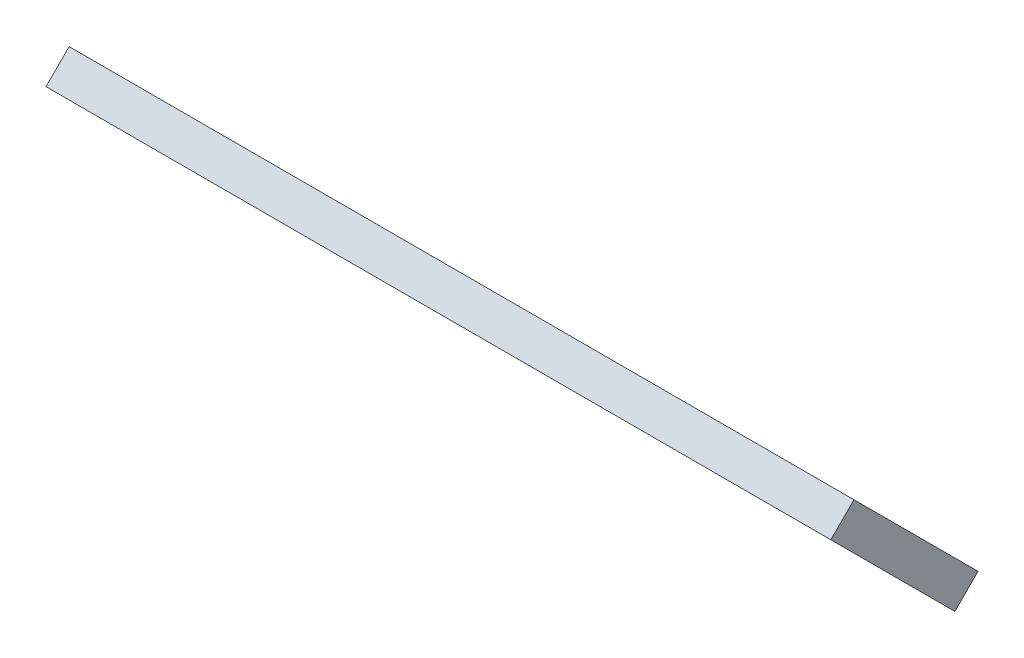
ISO-10303-21;
HEADER;
FILE_DESCRIPTION(('STEP AP214'),'2;1');
FILE_NAME('part.step','',(''),(''),'','','');
FILE_SCHEMA(('AUTOMOTIVE_DESIGN { 1 0 10303 214 1 1 1 1 }'));
ENDSEC;
DATA;
#1=APPLICATION_CONTEXT('core data for automotive mechanical design processes');
#2=APPLICATION_PROTOCOL_DEFINITION('international standard','automotive_design',2000,#1);
#3=PRODUCT_CONTEXT('',#1,'mechanical');
#4=PRODUCT('Part','Part','',(#3));
#5=PRODUCT_RELATED_PRODUCT_CATEGORY('part','',(#4));
#6=PRODUCT_DEFINITION_FORMATION('','',#4);
#7=PRODUCT_DEFINITION_CONTEXT('part definition',#1,'design');
#8=PRODUCT_DEFINITION('design','',#6,#7);
#9=PRODUCT_DEFINITION_SHAPE('','',#8);
#10=(LENGTH_UNIT() NAMED_UNIT(*) SI_UNIT(.MILLI.,.METRE.));
#11=(NAMED_UNIT(*) PLANE_ANGLE_UNIT() SI_UNIT($,.RADIAN.));
#12=(NAMED_UNIT(*) SI_UNIT($,.STERADIAN.) SOLID_ANGLE_UNIT());
#13=UNCERTAINTY_MEASURE_WITH_UNIT(LENGTH_MEASURE(1.E-05),#10,'distance_accuracy_value','');
#14=(GEOMETRIC_REPRESENTATION_CONTEXT(3) GLOBAL_UNCERTAINTY_ASSIGNED_CONTEXT((#13)) GLOBAL_UNIT_ASSIGNED_CONTEXT((#10,
#11,#12)) REPRESENTATION_CONTEXT('',''));
#15=CARTESIAN_POINT('',(0.,0.,0.));
#16=DIRECTION('',(0.,0.,1.));
#17=DIRECTION('',(1.,0.,0.));
#18=AXIS2_PLACEMENT_3D('',#15,#16,#17);
#19=CARTESIAN_POINT('',(-19.05,-1.12253201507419,1.12253201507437));
#20=DIRECTION('',(0.,-0.707106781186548,0.707106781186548));
#21=DIRECTION('',(0.,-0.707106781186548,-0.707106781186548));
#22=AXIS2_PLACEMENT_3D('',#19,#20,#21);
#23=CONICAL_SURFACE('',#22,4.29078831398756,0.709860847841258);
#24=CARTESIAN_POINT('',(-19.05,0.673519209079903,-0.673519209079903));
#25=DIRECTION('',(0.,0.707106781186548,-0.707106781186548));
#26=DIRECTION('',(0.,0.707106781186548,0.707106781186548));
#27=AXIS2_PLACEMENT_3D('',#24,#25,#26);
#28=CIRCLE('',#27,2.1082);
#29=CARTESIAN_POINT('',(-21.1582000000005,0.673519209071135,-0.673519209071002));
#30=VERTEX_POINT('',#29);
#31=CARTESIAN_POINT('',(-16.9418000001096,0.673519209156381,-0.67351920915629));
#32=VERTEX_POINT('',#31);
#33=EDGE_CURVE('E122',#30,#32,#28,.T.);
#34=ORIENTED_EDGE('',*,*,#33,.T.);
#35=DIRECTION('',(-0.6517282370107,0.536306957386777,-0.536306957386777));
#36=VECTOR('',#35,1.);
#37=CARTESIAN_POINT('',(498961.900000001,-410608.855497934,410608.855497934));
#38=LINE('',#37,#36);
#39=CARTESIAN_POINT('',(-14.7592116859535,-1.12253201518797,1.12253201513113));
#40=VERTEX_POINT('',#39);
#41=EDGE_CURVE('E90',#32,#40,#38,.F.);
#42=ORIENTED_EDGE('',*,*,#41,.T.);
#43=CARTESIAN_POINT('',(-19.05,-1.12253201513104,1.12253201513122));
#44=DIRECTION('',(0.,-0.707106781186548,0.707106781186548));
#45=DIRECTION('',(0.,-0.707106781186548,-0.707106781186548));
#46=AXIS2_PLACEMENT_3D('',#43,#44,#45);
#47=CIRCLE('',#46,4.29078831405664);
#48=CARTESIAN_POINT('',(-23.3407883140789,-1.12253201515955,1.12253201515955));
#49=VERTEX_POINT('',#48);
#50=EDGE_CURVE('E104',#49,#40,#47,.F.);
#51=ORIENTED_EDGE('',*,*,#50,.F.);
#52=DIRECTION('',(0.651728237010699,0.536306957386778,-0.536306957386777));
#53=VECTOR('',#52,1.);
#54=CARTESIAN_POINT('',(-499000.,-410608.855497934,410608.855497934));
#55=LINE('',#54,#53);
#56=EDGE_CURVE('E95',#49,#30,#55,.T.);
#57=ORIENTED_EDGE('',*,*,#56,.T.);
#58=EDGE_LOOP('',(#34,#42,#51,#57));
#59=FACE_BOUND('',#58,.T.);
#60=ADVANCED_FACE('F16',(#59),#23,.F.);
#61=CARTESIAN_POINT('',(-19.05,-1.12253201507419,1.12253201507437));
#62=DIRECTION('',(0.,-0.707106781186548,0.707106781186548));
#63=DIRECTION('',(0.,-0.707106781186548,-0.707106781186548));
#64=AXIS2_PLACEMENT_3D('',#61,#62,#63);
#65=CONICAL_SURFACE('',#64,4.29078831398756,0.709860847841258);
#66=CARTESIAN_POINT('',(-19.05,-1.12253201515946,1.12253201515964));
#67=DIRECTION('',(0.,-0.707106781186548,0.707106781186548));
#68=DIRECTION('',(0.,-0.707106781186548,-0.707106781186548));
#69=AXIS2_PLACEMENT_3D('',#66,#67,#68);
#70=CIRCLE('',#69,4.29078831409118);
#71=EDGE_CURVE('E19',#40,#49,#70,.F.);
#72=ORIENTED_EDGE('',*,*,#71,.F.);
#73=ORIENTED_EDGE('',*,*,#41,.F.);
#74=CARTESIAN_POINT('',(-19.05,0.673519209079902,-0.673519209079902));
#75=DIRECTION('',(0.,0.707106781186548,-0.707106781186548));
#76=DIRECTION('',(0.,0.707106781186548,0.707106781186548));
#77=AXIS2_PLACEMENT_3D('',#74,#75,#76);
#78=CIRCLE('',#77,2.1082);
#79=EDGE_CURVE('E100',#32,#30,#78,.T.);
#80=ORIENTED_EDGE('',*,*,#79,.T.);
#81=ORIENTED_EDGE('',*,*,#56,.F.);
#82=EDGE_LOOP('',(#72,#73,#80,#81));
#83=FACE_BOUND('',#82,.T.);
#84=ADVANCED_FACE('F96',(#83),#65,.F.);
#85=CARTESIAN_POINT('',(19.05,-1.12253201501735,1.12253201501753));
#86=DIRECTION('',(0.,-0.707106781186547,0.707106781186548));
#87=DIRECTION('',(0.,-0.707106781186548,-0.707106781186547));
#88=AXIS2_PLACEMENT_3D('',#85,#86,#87);
#89=CONICAL_SURFACE('',#88,4.29078831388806,0.709860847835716);
#90=CARTESIAN_POINT('',(19.05,0.673519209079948,-0.673519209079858));
#91=DIRECTION('',(0.,0.707106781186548,-0.707106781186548));
#92=DIRECTION('',(0.,0.707106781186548,0.707106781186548));
#93=AXIS2_PLACEMENT_3D('',#90,#91,#92);
#94=CIRCLE('',#93,2.1082);
#95=CARTESIAN_POINT('',(16.9418000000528,0.673519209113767,-0.673519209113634));
#96=VERTEX_POINT('',#95);
#97=CARTESIAN_POINT('',(21.1581999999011,0.673519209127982,-0.673519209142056));
#98=VERTEX_POINT('',#97);
#99=EDGE_CURVE('E163',#96,#98,#94,.T.);
#100=ORIENTED_EDGE('',*,*,#99,.T.);
#101=DIRECTION('',(-0.6517282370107,0.536306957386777,-0.536306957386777));
#102=VECTOR('',#101,1.);
#103=CARTESIAN_POINT('',(499038.100000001,-410640.207975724,410640.207975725));
#104=LINE('',#103,#102);
#105=CARTESIAN_POINT('',(23.3407883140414,-1.12253201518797,1.12253201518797));
#106=VERTEX_POINT('',#105);
#107=EDGE_CURVE('E102',#98,#106,#104,.F.);
#108=ORIENTED_EDGE('',*,*,#107,.T.);
#109=CARTESIAN_POINT('',(19.05,-1.12253201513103,1.12253201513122));
#110=DIRECTION('',(0.,-0.707106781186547,0.707106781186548));
#111=DIRECTION('',(0.,-0.707106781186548,-0.707106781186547));
#112=AXIS2_PLACEMENT_3D('',#109,#110,#111);
#113=CIRCLE('',#112,4.29078831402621);
#114=CARTESIAN_POINT('',(14.7592116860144,-1.12253201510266,1.12253201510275));
#115=VERTEX_POINT('',#114);
#116=EDGE_CURVE('E125',#115,#106,#113,.F.);
#117=ORIENTED_EDGE('',*,*,#116,.F.);
#118=DIRECTION('',(0.651728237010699,0.536306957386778,-0.536306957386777));
#119=VECTOR('',#118,1.);
#120=CARTESIAN_POINT('',(-499000.,-410640.207975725,410640.207975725));
#121=LINE('',#120,#119);
#122=EDGE_CURVE('E108',#115,#96,#121,.T.);
#123=ORIENTED_EDGE('',*,*,#122,.T.);
#124=EDGE_LOOP('',(#100,#108,#117,#123));
#125=FACE_BOUND('',#124,.T.);
#126=ADVANCED_FACE('F162',(#125),#89,.F.);
#127=CARTESIAN_POINT('',(19.05,-1.12253201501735,1.12253201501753));
#128=DIRECTION('',(0.,-0.707106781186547,0.707106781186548));
#129=DIRECTION('',(0.,-0.707106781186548,-0.707106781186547));
#130=AXIS2_PLACEMENT_3D('',#127,#128,#129);
#131=CONICAL_SURFACE('',#130,4.29078831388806,0.709860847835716);
#132=CARTESIAN_POINT('',(19.05,-1.12253201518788,1.12253201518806));
#133=DIRECTION('',(0.,-0.707106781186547,0.707106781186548));
#134=DIRECTION('',(0.,-0.707106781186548,-0.707106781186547));
#135=AXIS2_PLACEMENT_3D('',#132,#133,#134);
#136=CIRCLE('',#135,4.29078831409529);
#137=EDGE_CURVE('E106',#106,#115,#136,.F.);
#138=ORIENTED_EDGE('',*,*,#137,.F.);
#139=ORIENTED_EDGE('',*,*,#107,.F.);
#140=CARTESIAN_POINT('',(19.05,0.673519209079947,-0.673519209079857));
#141=DIRECTION('',(0.,0.707106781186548,-0.707106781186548));
#142=DIRECTION('',(0.,0.707106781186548,0.707106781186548));
#143=AXIS2_PLACEMENT_3D('',#140,#141,#142);
#144=CIRCLE('',#143,2.1082);
#145=EDGE_CURVE('E160',#98,#96,#144,.T.);
#146=ORIENTED_EDGE('',*,*,#145,.T.);
#147=ORIENTED_EDGE('',*,*,#122,.F.);
#148=EDGE_LOOP('',(#138,#139,#146,#147));
#149=FACE_BOUND('',#148,.T.);
#150=ADVANCED_FACE('F158',(#149),#131,.F.);
#151=CARTESIAN_POINT('',(38.1,4.89868596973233,7.14375));
#152=DIRECTION('',(0.,-0.707106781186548,0.707106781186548));
#153=DIRECTION('',(0.,-0.707106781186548,-0.707106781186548));
#154=AXIS2_PLACEMENT_3D('',#151,#152,#153);
#155=PLANE('',#154);
#156=DIRECTION('',(0.,0.707106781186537,0.707106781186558));
#157=VECTOR('',#156,1.);
#158=CARTESIAN_POINT('',(38.1,-7.14375,-4.89868596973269));
#159=LINE('',#158,#157);
#160=CARTESIAN_POINT('',(38.1,-7.14375000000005,-4.89868596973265));
#161=VERTEX_POINT('',#160);
#162=CARTESIAN_POINT('',(38.1,4.89868596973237,7.14375000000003));
#163=VERTEX_POINT('',#162);
#164=EDGE_CURVE('E300',#161,#163,#159,.T.);
#165=ORIENTED_EDGE('',*,*,#164,.T.);
#166=DIRECTION('',(1.,0.,0.));
#167=VECTOR('',#166,1.);
#168=CARTESIAN_POINT('',(38.1,4.89868596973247,7.14375000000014));
#169=LINE('',#168,#167);
#170=CARTESIAN_POINT('',(-38.1,4.89868596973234,7.14375000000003));
#171=VERTEX_POINT('',#170);
#172=EDGE_CURVE('E302',#171,#163,#169,.T.);
#173=ORIENTED_EDGE('',*,*,#172,.F.);
#174=DIRECTION('',(0.,0.707106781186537,0.707106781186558));
#175=VECTOR('',#174,1.);
#176=CARTESIAN_POINT('',(-38.1,-7.14375,-4.89868596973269));
#177=LINE('',#176,#175);
#178=CARTESIAN_POINT('',(-38.1,-7.14375000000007,-4.89868596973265));
#179=VERTEX_POINT('',#178);
#180=EDGE_CURVE('E319',#179,#171,#177,.T.);
#181=ORIENTED_EDGE('',*,*,#180,.F.);
#182=DIRECTION('',(1.,0.,0.));
#183=VECTOR('',#182,1.);
#184=CARTESIAN_POINT('',(38.1,-7.14375,-4.89868596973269));
#185=LINE('',#184,#183);
#186=EDGE_CURVE('E150',#161,#179,#185,.F.);
#187=ORIENTED_EDGE('',*,*,#186,.F.);
#188=EDGE_LOOP('',(#165,#173,#181,#187));
#189=FACE_BOUND('',#188,.T.);
#190=ORIENTED_EDGE('',*,*,#137,.T.);
#191=ORIENTED_EDGE('',*,*,#116,.T.);
#192=EDGE_LOOP('',(#190,#191));
#193=FACE_BOUND('',#192,.T.);
#194=ORIENTED_EDGE('',*,*,#71,.T.);
#195=ORIENTED_EDGE('',*,*,#50,.T.);
#196=EDGE_LOOP('',(#194,#195));
#197=FACE_BOUND('',#196,.T.);
#198=ADVANCED_FACE('F107',(#189,#193,#197),#155,.T.);
#199=CARTESIAN_POINT('',(-19.05,1.12253201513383,-1.12253201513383));
#200=DIRECTION('',(0.,0.707106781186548,-0.707106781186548));
#201=DIRECTION('',(0.,0.707106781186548,0.707106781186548));
#202=AXIS2_PLACEMENT_3D('',#199,#200,#201);
#203=CYLINDRICAL_SURFACE('',#202,2.1082);
#204=CARTESIAN_POINT('',(-19.05,1.12253201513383,-1.12253201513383));
#205=DIRECTION('',(0.,0.707106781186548,-0.707106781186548));
#206=DIRECTION('',(0.,0.707106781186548,0.707106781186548));
#207=AXIS2_PLACEMENT_3D('',#204,#205,#206);
#208=CIRCLE('',#207,2.1082);
#209=CARTESIAN_POINT('',(-16.9418,1.12253201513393,-1.12253201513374));
#210=VERTEX_POINT('',#209);
#211=CARTESIAN_POINT('',(-21.1582,1.12253201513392,-1.12253201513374));
#212=VERTEX_POINT('',#211);
#213=EDGE_CURVE('E147',#210,#212,#208,.F.);
#214=ORIENTED_EDGE('',*,*,#213,.F.);
#215=DIRECTION('',(0.,0.707106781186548,-0.707106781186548));
#216=VECTOR('',#215,1.);
#217=CARTESIAN_POINT('',(-16.9418,1.12253201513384,-1.12253201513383));
#218=LINE('',#217,#216);
#219=EDGE_CURVE('E124',#210,#32,#218,.F.);
#220=ORIENTED_EDGE('',*,*,#219,.T.);
#221=ORIENTED_EDGE('',*,*,#33,.F.);
#222=DIRECTION('',(0.,0.707106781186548,-0.707106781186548));
#223=VECTOR('',#222,1.);
#224=CARTESIAN_POINT('',(-21.1582,1.12253201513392,-1.12253201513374));
#225=LINE('',#224,#223);
#226=EDGE_CURVE('E129',#30,#212,#225,.T.);
#227=ORIENTED_EDGE('',*,*,#226,.T.);
#228=EDGE_LOOP('',(#214,#220,#221,#227));
#229=FACE_BOUND('',#228,.T.);
#230=ADVANCED_FACE('F191',(#229),#203,.F.);
#231=CARTESIAN_POINT('',(-19.05,1.12253201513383,-1.12253201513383));
#232=DIRECTION('',(0.,0.707106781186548,-0.707106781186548));
#233=DIRECTION('',(0.,0.707106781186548,0.707106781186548));
#234=AXIS2_PLACEMENT_3D('',#231,#232,#233);
#235=CYLINDRICAL_SURFACE('',#234,2.1082);
#236=ORIENTED_EDGE('',*,*,#79,.F.);
#237=ORIENTED_EDGE('',*,*,#219,.F.);
#238=CARTESIAN_POINT('',(-19.05,1.12253201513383,-1.12253201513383));
#239=DIRECTION('',(0.,0.707106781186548,-0.707106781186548));
#240=DIRECTION('',(0.,0.707106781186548,0.707106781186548));
#241=AXIS2_PLACEMENT_3D('',#238,#239,#240);
#242=CIRCLE('',#241,2.1082);
#243=EDGE_CURVE('E144',#212,#210,#242,.F.);
#244=ORIENTED_EDGE('',*,*,#243,.F.);
#245=ORIENTED_EDGE('',*,*,#226,.F.);
#246=EDGE_LOOP('',(#236,#237,#244,#245));
#247=FACE_BOUND('',#246,.T.);
#248=ADVANCED_FACE('F195',(#247),#235,.F.);
#249=CARTESIAN_POINT('',(19.05,1.12253201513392,-1.12253201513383));
#250=DIRECTION('',(0.,0.707106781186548,-0.707106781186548));
#251=DIRECTION('',(0.,0.707106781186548,0.707106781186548));
#252=AXIS2_PLACEMENT_3D('',#249,#250,#251);
#253=CYLINDRICAL_SURFACE('',#252,2.1082);
#254=CARTESIAN_POINT('',(19.05,1.12253201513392,-1.12253201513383));
#255=DIRECTION('',(0.,0.707106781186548,-0.707106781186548));
#256=DIRECTION('',(0.,0.707106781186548,0.707106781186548));
#257=AXIS2_PLACEMENT_3D('',#254,#255,#256);
#258=CIRCLE('',#257,2.1082);
#259=CARTESIAN_POINT('',(21.1582,1.12253201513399,-1.12253201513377));
#260=VERTEX_POINT('',#259);
#261=CARTESIAN_POINT('',(16.9418,1.12253201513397,-1.12253201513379));
#262=VERTEX_POINT('',#261);
#263=EDGE_CURVE('E141',#260,#262,#258,.F.);
#264=ORIENTED_EDGE('',*,*,#263,.F.);
#265=DIRECTION('',(0.,0.707106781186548,-0.707106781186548));
#266=VECTOR('',#265,1.);
#267=CARTESIAN_POINT('',(21.1582,1.12253201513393,-1.12253201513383));
#268=LINE('',#267,#266);
#269=EDGE_CURVE('E167',#260,#98,#268,.F.);
#270=ORIENTED_EDGE('',*,*,#269,.T.);
#271=ORIENTED_EDGE('',*,*,#99,.F.);
#272=DIRECTION('',(0.,0.707106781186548,-0.707106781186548));
#273=VECTOR('',#272,1.);
#274=CARTESIAN_POINT('',(16.9418,1.12253201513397,-1.12253201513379));
#275=LINE('',#274,#273);
#276=EDGE_CURVE('E174',#96,#262,#275,.T.);
#277=ORIENTED_EDGE('',*,*,#276,.T.);
#278=EDGE_LOOP('',(#264,#270,#271,#277));
#279=FACE_BOUND('',#278,.T.);
#280=ADVANCED_FACE('F170',(#279),#253,.F.);
#281=CARTESIAN_POINT('',(19.05,1.12253201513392,-1.12253201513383));
#282=DIRECTION('',(0.,0.707106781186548,-0.707106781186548));
#283=DIRECTION('',(0.,0.707106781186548,0.707106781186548));
#284=AXIS2_PLACEMENT_3D('',#281,#282,#283);
#285=CYLINDRICAL_SURFACE('',#284,2.1082);
#286=ORIENTED_EDGE('',*,*,#145,.F.);
#287=ORIENTED_EDGE('',*,*,#269,.F.);
#288=CARTESIAN_POINT('',(19.05,1.12253201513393,-1.12253201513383));
#289=DIRECTION('',(0.,0.707106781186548,-0.707106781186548));
#290=DIRECTION('',(0.,0.707106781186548,0.707106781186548));
#291=AXIS2_PLACEMENT_3D('',#288,#289,#290);
#292=CIRCLE('',#291,2.1082);
#293=EDGE_CURVE('E137',#262,#260,#292,.F.);
#294=ORIENTED_EDGE('',*,*,#293,.F.);
#295=ORIENTED_EDGE('',*,*,#276,.F.);
#296=EDGE_LOOP('',(#286,#287,#294,#295));
#297=FACE_BOUND('',#296,.T.);
#298=ADVANCED_FACE('F221',(#297),#285,.F.);
#299=CARTESIAN_POINT('',(-38.1,4.89868596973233,7.14375));
#300=DIRECTION('',(-1.,0.,0.));
#301=DIRECTION('',(0.,-1.,0.));
#302=AXIS2_PLACEMENT_3D('',#299,#300,#301);
#303=PLANE('',#302);
#304=DIRECTION('',(0.,0.707106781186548,0.707106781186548));
#305=VECTOR('',#304,1.);
#306=CARTESIAN_POINT('',(-38.1,-4.89868596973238,-7.14374999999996));
#307=LINE('',#306,#305);
#308=CARTESIAN_POINT('',(-38.1,-4.8986859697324,-7.14375000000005));
#309=VERTEX_POINT('',#308);
#310=CARTESIAN_POINT('',(-38.1,7.14375,4.89868596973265));
#311=VERTEX_POINT('',#310);
#312=EDGE_CURVE('E140',#309,#311,#307,.T.);
#313=ORIENTED_EDGE('',*,*,#312,.F.);
#314=DIRECTION('',(0.,0.707106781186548,-0.707106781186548));
#315=VECTOR('',#314,1.);
#316=CARTESIAN_POINT('',(-38.1,-7.14375000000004,-4.89868596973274));
#317=LINE('',#316,#315);
#318=EDGE_CURVE('E312',#179,#309,#317,.T.);
#319=ORIENTED_EDGE('',*,*,#318,.F.);
#320=ORIENTED_EDGE('',*,*,#180,.T.);
#321=DIRECTION('',(0.,-0.707106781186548,0.707106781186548));
#322=VECTOR('',#321,1.);
#323=CARTESIAN_POINT('',(-38.1,7.14374999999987,4.89868596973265));
#324=LINE('',#323,#322);
#325=EDGE_CURVE('E309',#311,#171,#324,.T.);
#326=ORIENTED_EDGE('',*,*,#325,.F.);
#327=EDGE_LOOP('',(#313,#319,#320,#326));
#328=FACE_BOUND('',#327,.T.);
#329=ADVANCED_FACE('F217',(#328),#303,.T.);
#330=CARTESIAN_POINT('',(38.1,7.14374999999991,4.89868596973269));
#331=DIRECTION('',(0.,0.707106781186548,0.707106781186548));
#332=DIRECTION('',(0.,-0.707106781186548,0.707106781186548));
#333=AXIS2_PLACEMENT_3D('',#330,#331,#332);
#334=PLANE('',#333);
#335=DIRECTION('',(0.,0.70710678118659,-0.707106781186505));
#336=VECTOR('',#335,1.);
#337=CARTESIAN_POINT('',(38.1,4.89868596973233,7.14375));
#338=LINE('',#337,#336);
#339=CARTESIAN_POINT('',(38.1,7.14374999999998,4.89868596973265));
#340=VERTEX_POINT('',#339);
#341=EDGE_CURVE('E306',#163,#340,#338,.T.);
#342=ORIENTED_EDGE('',*,*,#341,.T.);
#343=DIRECTION('',(1.,0.,0.));
#344=VECTOR('',#343,1.);
#345=CARTESIAN_POINT('',(38.1,7.14375000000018,4.89868596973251));
#346=LINE('',#345,#344);
#347=EDGE_CURVE('E325',#311,#340,#346,.T.);
#348=ORIENTED_EDGE('',*,*,#347,.F.);
#349=ORIENTED_EDGE('',*,*,#325,.T.);
#350=ORIENTED_EDGE('',*,*,#172,.T.);
#351=EDGE_LOOP('',(#342,#348,#349,#350));
#352=FACE_BOUND('',#351,.T.);
#353=ADVANCED_FACE('F214',(#352),#334,.T.);
#354=CARTESIAN_POINT('',(38.1,0.,0.));
#355=DIRECTION('',(-1.,0.,0.));
#356=DIRECTION('',(0.,-1.,0.));
#357=AXIS2_PLACEMENT_3D('',#354,#355,#356);
#358=PLANE('',#357);
#359=ORIENTED_EDGE('',*,*,#164,.F.);
#360=DIRECTION('',(0.,0.707106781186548,-0.707106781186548));
#361=VECTOR('',#360,1.);
#362=CARTESIAN_POINT('',(38.1,-7.14375,-4.89868596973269));
#363=LINE('',#362,#361);
#364=CARTESIAN_POINT('',(38.1,-4.89868596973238,-7.14375000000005));
#365=VERTEX_POINT('',#364);
#366=EDGE_CURVE('E34',#365,#161,#363,.F.);
#367=ORIENTED_EDGE('',*,*,#366,.F.);
#368=DIRECTION('',(0.,0.707106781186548,0.707106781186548));
#369=VECTOR('',#368,1.);
#370=CARTESIAN_POINT('',(38.1,-4.89868596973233,-7.14375));
#371=LINE('',#370,#369);
#372=EDGE_CURVE('E25',#340,#365,#371,.F.);
#373=ORIENTED_EDGE('',*,*,#372,.F.);
#374=ORIENTED_EDGE('',*,*,#341,.F.);
#375=EDGE_LOOP('',(#359,#367,#373,#374));
#376=FACE_BOUND('',#375,.T.);
#377=ADVANCED_FACE('F206',(#376),#358,.F.);
#378=CARTESIAN_POINT('',(38.1,-7.14375,-4.89868596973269));
#379=DIRECTION('',(0.,-0.707106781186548,-0.707106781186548));
#380=DIRECTION('',(0.,0.707106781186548,-0.707106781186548));
#381=AXIS2_PLACEMENT_3D('',#378,#379,#380);
#382=PLANE('',#381);
#383=ORIENTED_EDGE('',*,*,#366,.T.);
#384=ORIENTED_EDGE('',*,*,#186,.T.);
#385=ORIENTED_EDGE('',*,*,#318,.T.);
#386=DIRECTION('',(1.,0.,0.));
#387=VECTOR('',#386,1.);
#388=CARTESIAN_POINT('',(38.1,-4.89868596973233,-7.14375));
#389=LINE('',#388,#387);
#390=EDGE_CURVE('E11',#365,#309,#389,.F.);
#391=ORIENTED_EDGE('',*,*,#390,.F.);
#392=EDGE_LOOP('',(#383,#384,#385,#391));
#393=FACE_BOUND('',#392,.T.);
#394=ADVANCED_FACE('F199',(#393),#382,.T.);
#395=CARTESIAN_POINT('',(38.1,-4.89868596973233,-7.14375));
#396=DIRECTION('',(0.,0.707106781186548,-0.707106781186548));
#397=DIRECTION('',(0.,0.707106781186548,0.707106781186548));
#398=AXIS2_PLACEMENT_3D('',#395,#396,#397);
#399=PLANE('',#398);
#400=ORIENTED_EDGE('',*,*,#372,.T.);
#401=ORIENTED_EDGE('',*,*,#390,.T.);
#402=ORIENTED_EDGE('',*,*,#312,.T.);
#403=ORIENTED_EDGE('',*,*,#347,.T.);
#404=EDGE_LOOP('',(#400,#401,#402,#403));
#405=FACE_BOUND('',#404,.T.);
#406=ORIENTED_EDGE('',*,*,#263,.T.);
#407=ORIENTED_EDGE('',*,*,#293,.T.);
#408=EDGE_LOOP('',(#406,#407));
#409=FACE_BOUND('',#408,.T.);
#410=ORIENTED_EDGE('',*,*,#213,.T.);
#411=ORIENTED_EDGE('',*,*,#243,.T.);
#412=EDGE_LOOP('',(#410,#411));
#413=FACE_BOUND('',#412,.T.);
#414=ADVANCED_FACE('F197',(#405,#409,#413),#399,.T.);
#415=CLOSED_SHELL('',(#60,#84,#126,#150,#198,#230,#248,#280,#298,#329,#353,#377,#394,#414));
#416=MANIFOLD_SOLID_BREP('B1',#415);
#417=ADVANCED_BREP_SHAPE_REPRESENTATION('',(#18,#416),#14);
#418=SHAPE_DEFINITION_REPRESENTATION(#9,#417);
ENDSEC;
END-ISO-10303-21;
